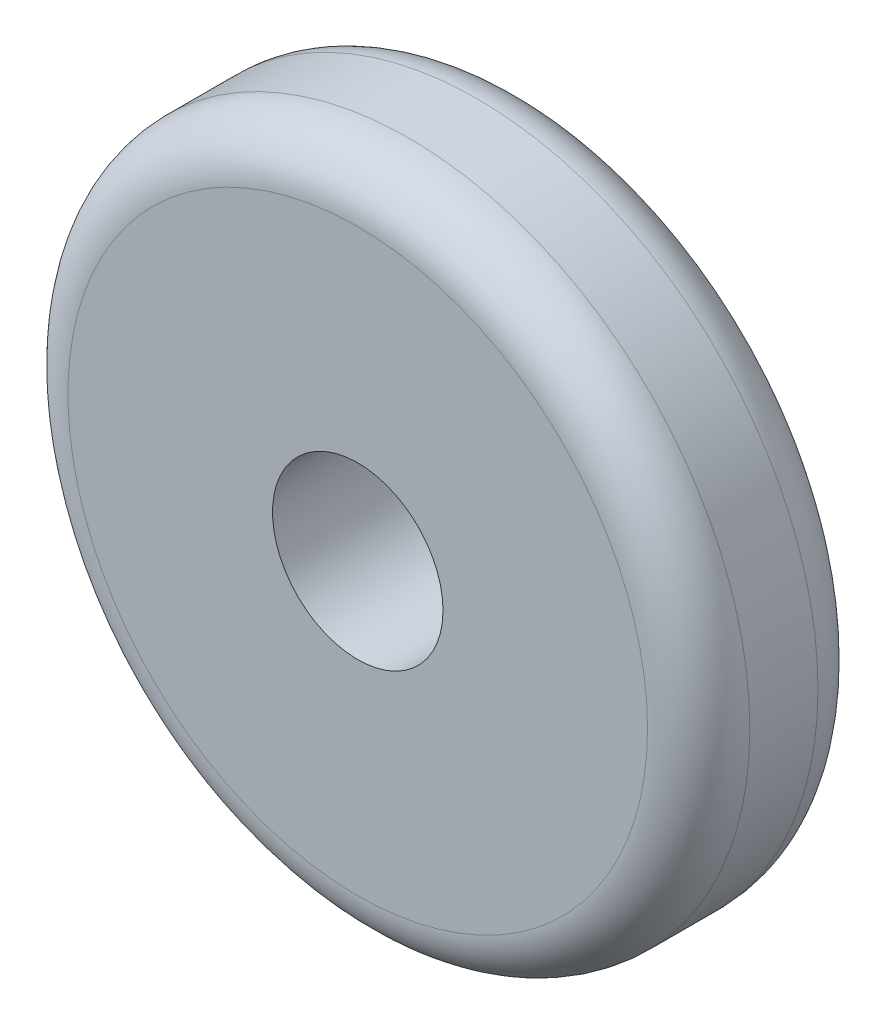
ISO-10303-21;
HEADER;
FILE_DESCRIPTION(('STEP AP214'),'2;1');
FILE_NAME('part.step','',(''),(''),'','','');
FILE_SCHEMA(('AUTOMOTIVE_DESIGN { 1 0 10303 214 1 1 1 1 }'));
ENDSEC;
DATA;
#1=APPLICATION_CONTEXT('core data for automotive mechanical design processes');
#2=APPLICATION_PROTOCOL_DEFINITION('international standard','automotive_design',2000,#1);
#3=PRODUCT_CONTEXT('',#1,'mechanical');
#4=PRODUCT('Part','Part','',(#3));
#5=PRODUCT_RELATED_PRODUCT_CATEGORY('part','',(#4));
#6=PRODUCT_DEFINITION_FORMATION('','',#4);
#7=PRODUCT_DEFINITION_CONTEXT('part definition',#1,'design');
#8=PRODUCT_DEFINITION('design','',#6,#7);
#9=PRODUCT_DEFINITION_SHAPE('','',#8);
#10=(LENGTH_UNIT() NAMED_UNIT(*) SI_UNIT(.MILLI.,.METRE.));
#11=(NAMED_UNIT(*) PLANE_ANGLE_UNIT() SI_UNIT($,.RADIAN.));
#12=(NAMED_UNIT(*) SI_UNIT($,.STERADIAN.) SOLID_ANGLE_UNIT());
#13=UNCERTAINTY_MEASURE_WITH_UNIT(LENGTH_MEASURE(1.E-05),#10,'distance_accuracy_value','');
#14=(GEOMETRIC_REPRESENTATION_CONTEXT(3) GLOBAL_UNCERTAINTY_ASSIGNED_CONTEXT((#13)) GLOBAL_UNIT_ASSIGNED_CONTEXT((#10,
#11,#12)) REPRESENTATION_CONTEXT('',''));
#15=CARTESIAN_POINT('',(0.,0.,0.));
#16=DIRECTION('',(0.,0.,1.));
#17=DIRECTION('',(1.,0.,0.));
#18=AXIS2_PLACEMENT_3D('',#15,#16,#17);
#19=CARTESIAN_POINT('',(-21.1503267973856,29.962962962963,10.));
#20=DIRECTION('',(0.,0.,1.));
#21=DIRECTION('',(1.,0.,0.));
#22=AXIS2_PLACEMENT_3D('',#19,#20,#21);
#23=PLANE('',#22);
#24=CARTESIAN_POINT('',(-21.1503267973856,29.962962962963,10.));
#25=DIRECTION('',(0.,0.,1.));
#26=DIRECTION('',(1.,0.,0.));
#27=AXIS2_PLACEMENT_3D('',#24,#25,#26);
#28=CIRCLE('',#27,17.);
#29=CARTESIAN_POINT('',(-4.15032679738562,29.962962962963,10.));
#30=VERTEX_POINT('',#29);
#31=EDGE_CURVE('E10',#30,#30,#28,.T.);
#32=ORIENTED_EDGE('',*,*,#31,.T.);
#33=EDGE_LOOP('',(#32));
#34=FACE_BOUND('',#33,.T.);
#35=CARTESIAN_POINT('',(-21.1503267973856,29.962962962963,10.));
#36=DIRECTION('',(0.,0.,1.));
#37=DIRECTION('',(1.,0.,0.));
#38=AXIS2_PLACEMENT_3D('',#35,#36,#37);
#39=CIRCLE('',#38,5.);
#40=CARTESIAN_POINT('',(-16.1503267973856,29.962962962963,10.));
#41=VERTEX_POINT('',#40);
#42=EDGE_CURVE('E48',#41,#41,#39,.T.);
#43=ORIENTED_EDGE('',*,*,#42,.F.);
#44=EDGE_LOOP('',(#43));
#45=FACE_BOUND('',#44,.T.);
#46=ADVANCED_FACE('F28',(#34,#45),#23,.T.);
#47=CARTESIAN_POINT('',(-21.1503267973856,29.962962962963,0.));
#48=DIRECTION('',(0.,0.,1.));
#49=DIRECTION('',(1.,0.,0.));
#50=AXIS2_PLACEMENT_3D('',#47,#48,#49);
#51=PLANE('',#50);
#52=CARTESIAN_POINT('',(-21.1503267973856,29.962962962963,0.));
#53=DIRECTION('',(0.,0.,1.));
#54=DIRECTION('',(1.,0.,0.));
#55=AXIS2_PLACEMENT_3D('',#52,#53,#54);
#56=CIRCLE('',#55,17.);
#57=CARTESIAN_POINT('',(-4.15032679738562,29.962962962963,0.));
#58=VERTEX_POINT('',#57);
#59=EDGE_CURVE('E35',#58,#58,#56,.F.);
#60=ORIENTED_EDGE('',*,*,#59,.T.);
#61=EDGE_LOOP('',(#60));
#62=FACE_BOUND('',#61,.T.);
#63=CARTESIAN_POINT('',(-21.1503267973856,29.962962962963,0.));
#64=DIRECTION('',(0.,0.,1.));
#65=DIRECTION('',(1.,0.,0.));
#66=AXIS2_PLACEMENT_3D('',#63,#64,#65);
#67=CIRCLE('',#66,5.);
#68=CARTESIAN_POINT('',(-16.1503267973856,29.962962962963,0.));
#69=VERTEX_POINT('',#68);
#70=EDGE_CURVE('E49',#69,#69,#67,.T.);
#71=ORIENTED_EDGE('',*,*,#70,.T.);
#72=EDGE_LOOP('',(#71));
#73=FACE_BOUND('',#72,.T.);
#74=ADVANCED_FACE('F59',(#62,#73),#51,.F.);
#75=CARTESIAN_POINT('',(-21.1503267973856,29.962962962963,10.));
#76=DIRECTION('',(0.,0.,-1.));
#77=DIRECTION('',(-1.,0.,0.));
#78=AXIS2_PLACEMENT_3D('',#75,#76,#77);
#79=CYLINDRICAL_SURFACE('',#78,20.);
#80=CARTESIAN_POINT('',(-21.1503267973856,29.962962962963,3.));
#81=DIRECTION('',(0.,0.,1.));
#82=DIRECTION('',(1.,0.,0.));
#83=AXIS2_PLACEMENT_3D('',#80,#81,#82);
#84=CIRCLE('',#83,20.);
#85=CARTESIAN_POINT('',(-1.15032679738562,29.962962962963,3.));
#86=VERTEX_POINT('',#85);
#87=EDGE_CURVE('E39',#86,#86,#84,.T.);
#88=ORIENTED_EDGE('',*,*,#87,.T.);
#89=EDGE_LOOP('',(#88));
#90=FACE_BOUND('',#89,.T.);
#91=CARTESIAN_POINT('',(-21.1503267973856,29.962962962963,7.));
#92=DIRECTION('',(0.,0.,1.));
#93=DIRECTION('',(1.,0.,0.));
#94=AXIS2_PLACEMENT_3D('',#91,#92,#93);
#95=CIRCLE('',#94,20.);
#96=CARTESIAN_POINT('',(-1.15032679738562,29.962962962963,7.));
#97=VERTEX_POINT('',#96);
#98=EDGE_CURVE('E43',#97,#97,#95,.F.);
#99=ORIENTED_EDGE('',*,*,#98,.T.);
#100=EDGE_LOOP('',(#99));
#101=FACE_BOUND('',#100,.T.);
#102=ADVANCED_FACE('F64',(#90,#101),#79,.T.);
#103=CARTESIAN_POINT('',(-21.1503267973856,29.962962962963,10.));
#104=DIRECTION('',(0.,0.,-1.));
#105=DIRECTION('',(-1.,0.,0.));
#106=AXIS2_PLACEMENT_3D('',#103,#104,#105);
#107=CYLINDRICAL_SURFACE('',#106,5.);
#108=ORIENTED_EDGE('',*,*,#42,.T.);
#109=EDGE_LOOP('',(#108));
#110=FACE_BOUND('',#109,.T.);
#111=ORIENTED_EDGE('',*,*,#70,.F.);
#112=EDGE_LOOP('',(#111));
#113=FACE_BOUND('',#112,.T.);
#114=ADVANCED_FACE('F55',(#110,#113),#107,.F.);
#115=CARTESIAN_POINT('',(-21.1503267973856,29.962962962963,3.));
#116=DIRECTION('',(0.,0.,1.));
#117=DIRECTION('',(1.,0.,0.));
#118=AXIS2_PLACEMENT_3D('',#115,#116,#117);
#119=TOROIDAL_SURFACE('',#118,17.,3.);
#120=ORIENTED_EDGE('',*,*,#59,.F.);
#121=EDGE_LOOP('',(#120));
#122=FACE_BOUND('',#121,.T.);
#123=ORIENTED_EDGE('',*,*,#87,.F.);
#124=EDGE_LOOP('',(#123));
#125=FACE_BOUND('',#124,.T.);
#126=ADVANCED_FACE('F70',(#122,#125),#119,.T.);
#127=CARTESIAN_POINT('',(-21.1503267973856,29.962962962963,7.));
#128=DIRECTION('',(0.,0.,1.));
#129=DIRECTION('',(1.,0.,0.));
#130=AXIS2_PLACEMENT_3D('',#127,#128,#129);
#131=TOROIDAL_SURFACE('',#130,17.,3.);
#132=ORIENTED_EDGE('',*,*,#98,.F.);
#133=EDGE_LOOP('',(#132));
#134=FACE_BOUND('',#133,.T.);
#135=ORIENTED_EDGE('',*,*,#31,.F.);
#136=EDGE_LOOP('',(#135));
#137=FACE_BOUND('',#136,.T.);
#138=ADVANCED_FACE('F30',(#134,#137),#131,.T.);
#139=CLOSED_SHELL('',(#46,#74,#102,#114,#126,#138));
#140=MANIFOLD_SOLID_BREP('B2',#139);
#141=ADVANCED_BREP_SHAPE_REPRESENTATION('',(#18,#140),#14);
#142=SHAPE_DEFINITION_REPRESENTATION(#9,#141);
ENDSEC;
END-ISO-10303-21;
